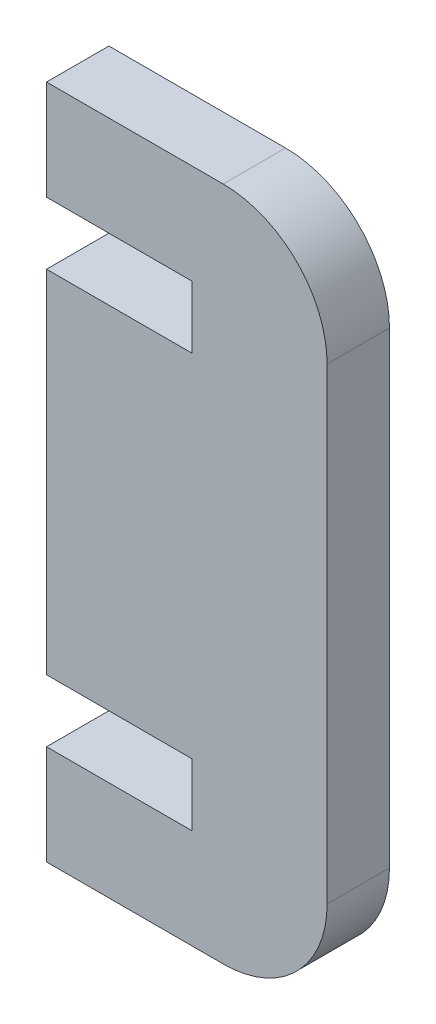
ISO-10303-21;
HEADER;
FILE_DESCRIPTION(('STEP AP214'),'2;1');
FILE_NAME('part.step','',(''),(''),'','','');
FILE_SCHEMA(('AUTOMOTIVE_DESIGN { 1 0 10303 214 1 1 1 1 }'));
ENDSEC;
DATA;
#1=APPLICATION_CONTEXT('core data for automotive mechanical design processes');
#2=APPLICATION_PROTOCOL_DEFINITION('international standard','automotive_design',2000,#1);
#3=PRODUCT_CONTEXT('',#1,'mechanical');
#4=PRODUCT('Part','Part','',(#3));
#5=PRODUCT_RELATED_PRODUCT_CATEGORY('part','',(#4));
#6=PRODUCT_DEFINITION_FORMATION('','',#4);
#7=PRODUCT_DEFINITION_CONTEXT('part definition',#1,'design');
#8=PRODUCT_DEFINITION('design','',#6,#7);
#9=PRODUCT_DEFINITION_SHAPE('','',#8);
#10=(LENGTH_UNIT() NAMED_UNIT(*) SI_UNIT(.MILLI.,.METRE.));
#11=(NAMED_UNIT(*) PLANE_ANGLE_UNIT() SI_UNIT($,.RADIAN.));
#12=(NAMED_UNIT(*) SI_UNIT($,.STERADIAN.) SOLID_ANGLE_UNIT());
#13=UNCERTAINTY_MEASURE_WITH_UNIT(LENGTH_MEASURE(1.E-05),#10,'distance_accuracy_value','');
#14=(GEOMETRIC_REPRESENTATION_CONTEXT(3) GLOBAL_UNCERTAINTY_ASSIGNED_CONTEXT((#13)) GLOBAL_UNIT_ASSIGNED_CONTEXT((#10,
#11,#12)) REPRESENTATION_CONTEXT('',''));
#15=CARTESIAN_POINT('',(0.,0.,0.));
#16=DIRECTION('',(0.,0.,1.));
#17=DIRECTION('',(1.,0.,0.));
#18=AXIS2_PLACEMENT_3D('',#15,#16,#17);
#19=CARTESIAN_POINT('',(-6.75,16.25,3.));
#20=DIRECTION('',(1.,0.,0.));
#21=DIRECTION('',(0.,0.,-1.));
#22=AXIS2_PLACEMENT_3D('',#19,#20,#21);
#23=PLANE('',#22);
#24=DIRECTION('',(0.,-1.,0.));
#25=VECTOR('',#24,1.);
#26=CARTESIAN_POINT('',(-6.75,16.25,0.));
#27=LINE('',#26,#25);
#28=CARTESIAN_POINT('',(-6.75,16.25,0.));
#29=VERTEX_POINT('',#28);
#30=CARTESIAN_POINT('',(-6.75,11.45,0.));
#31=VERTEX_POINT('',#30);
#32=EDGE_CURVE('E169',#29,#31,#27,.T.);
#33=ORIENTED_EDGE('',*,*,#32,.T.);
#34=DIRECTION('',(0.,0.,-1.));
#35=VECTOR('',#34,1.);
#36=CARTESIAN_POINT('',(-6.75,11.45,3.));
#37=LINE('',#36,#35);
#38=CARTESIAN_POINT('',(-6.75,11.45,3.));
#39=VERTEX_POINT('',#38);
#40=EDGE_CURVE('E11',#39,#31,#37,.T.);
#41=ORIENTED_EDGE('',*,*,#40,.F.);
#42=DIRECTION('',(0.,-1.,0.));
#43=VECTOR('',#42,1.);
#44=CARTESIAN_POINT('',(-6.75,16.25,3.));
#45=LINE('',#44,#43);
#46=CARTESIAN_POINT('',(-6.75,16.25,3.));
#47=VERTEX_POINT('',#46);
#48=EDGE_CURVE('E195',#47,#39,#45,.T.);
#49=ORIENTED_EDGE('',*,*,#48,.F.);
#50=DIRECTION('',(0.,0.,-1.));
#51=VECTOR('',#50,1.);
#52=CARTESIAN_POINT('',(-6.75,16.25,3.));
#53=LINE('',#52,#51);
#54=EDGE_CURVE('E165',#47,#29,#53,.T.);
#55=ORIENTED_EDGE('',*,*,#54,.T.);
#56=EDGE_LOOP('',(#33,#41,#49,#55));
#57=FACE_BOUND('',#56,.T.);
#58=ADVANCED_FACE('F37',(#57),#23,.F.);
#59=CARTESIAN_POINT('',(-6.75,11.45,3.));
#60=DIRECTION('',(0.,1.,0.));
#61=DIRECTION('',(0.,0.,1.));
#62=AXIS2_PLACEMENT_3D('',#59,#60,#61);
#63=PLANE('',#62);
#64=DIRECTION('',(1.,0.,0.));
#65=VECTOR('',#64,1.);
#66=CARTESIAN_POINT('',(-6.75,11.45,0.));
#67=LINE('',#66,#65);
#68=CARTESIAN_POINT('',(0.249999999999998,11.45,0.));
#69=VERTEX_POINT('',#68);
#70=EDGE_CURVE('E172',#31,#69,#67,.T.);
#71=ORIENTED_EDGE('',*,*,#70,.T.);
#72=DIRECTION('',(0.,0.,-1.));
#73=VECTOR('',#72,1.);
#74=CARTESIAN_POINT('',(0.249999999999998,11.45,3.));
#75=LINE('',#74,#73);
#76=CARTESIAN_POINT('',(0.249999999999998,11.45,3.));
#77=VERTEX_POINT('',#76);
#78=EDGE_CURVE('E45',#77,#69,#75,.T.);
#79=ORIENTED_EDGE('',*,*,#78,.F.);
#80=DIRECTION('',(1.,0.,0.));
#81=VECTOR('',#80,1.);
#82=CARTESIAN_POINT('',(-6.75,11.45,3.));
#83=LINE('',#82,#81);
#84=EDGE_CURVE('E114',#39,#77,#83,.T.);
#85=ORIENTED_EDGE('',*,*,#84,.F.);
#86=ORIENTED_EDGE('',*,*,#40,.T.);
#87=EDGE_LOOP('',(#71,#79,#85,#86));
#88=FACE_BOUND('',#87,.T.);
#89=ADVANCED_FACE('F283',(#88),#63,.F.);
#90=CARTESIAN_POINT('',(0.249999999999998,11.45,3.));
#91=DIRECTION('',(1.,0.,0.));
#92=DIRECTION('',(0.,1.,0.));
#93=AXIS2_PLACEMENT_3D('',#90,#91,#92);
#94=PLANE('',#93);
#95=DIRECTION('',(0.,-1.,0.));
#96=VECTOR('',#95,1.);
#97=CARTESIAN_POINT('',(0.249999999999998,11.45,0.));
#98=LINE('',#97,#96);
#99=CARTESIAN_POINT('',(0.249999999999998,8.45,0.));
#100=VERTEX_POINT('',#99);
#101=EDGE_CURVE('E174',#69,#100,#98,.T.);
#102=ORIENTED_EDGE('',*,*,#101,.T.);
#103=DIRECTION('',(0.,0.,-1.));
#104=VECTOR('',#103,1.);
#105=CARTESIAN_POINT('',(0.249999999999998,8.45,3.));
#106=LINE('',#105,#104);
#107=CARTESIAN_POINT('',(0.249999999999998,8.45,3.));
#108=VERTEX_POINT('',#107);
#109=EDGE_CURVE('E220',#108,#100,#106,.T.);
#110=ORIENTED_EDGE('',*,*,#109,.F.);
#111=DIRECTION('',(0.,-1.,0.));
#112=VECTOR('',#111,1.);
#113=CARTESIAN_POINT('',(0.249999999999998,11.45,3.));
#114=LINE('',#113,#112);
#115=EDGE_CURVE('E228',#77,#108,#114,.T.);
#116=ORIENTED_EDGE('',*,*,#115,.F.);
#117=ORIENTED_EDGE('',*,*,#78,.T.);
#118=EDGE_LOOP('',(#102,#110,#116,#117));
#119=FACE_BOUND('',#118,.T.);
#120=ADVANCED_FACE('F226',(#119),#94,.F.);
#121=CARTESIAN_POINT('',(-6.75,8.45,3.));
#122=DIRECTION('',(0.,-1.,0.));
#123=DIRECTION('',(0.,0.,-1.));
#124=AXIS2_PLACEMENT_3D('',#121,#122,#123);
#125=PLANE('',#124);
#126=DIRECTION('',(-1.,0.,0.));
#127=VECTOR('',#126,1.);
#128=CARTESIAN_POINT('',(-6.75,8.45,0.));
#129=LINE('',#128,#127);
#130=CARTESIAN_POINT('',(-6.75,8.45,0.));
#131=VERTEX_POINT('',#130);
#132=EDGE_CURVE('E176',#100,#131,#129,.T.);
#133=ORIENTED_EDGE('',*,*,#132,.T.);
#134=DIRECTION('',(0.,0.,-1.));
#135=VECTOR('',#134,1.);
#136=CARTESIAN_POINT('',(-6.75,8.45,3.));
#137=LINE('',#136,#135);
#138=CARTESIAN_POINT('',(-6.75,8.45,3.));
#139=VERTEX_POINT('',#138);
#140=EDGE_CURVE('E217',#139,#131,#137,.T.);
#141=ORIENTED_EDGE('',*,*,#140,.F.);
#142=DIRECTION('',(-1.,0.,0.));
#143=VECTOR('',#142,1.);
#144=CARTESIAN_POINT('',(-6.75,8.45,3.));
#145=LINE('',#144,#143);
#146=EDGE_CURVE('E246',#108,#139,#145,.T.);
#147=ORIENTED_EDGE('',*,*,#146,.F.);
#148=ORIENTED_EDGE('',*,*,#109,.T.);
#149=EDGE_LOOP('',(#133,#141,#147,#148));
#150=FACE_BOUND('',#149,.T.);
#151=ADVANCED_FACE('F237',(#150),#125,.F.);
#152=CARTESIAN_POINT('',(-6.75,8.45,3.));
#153=DIRECTION('',(1.,0.,0.));
#154=DIRECTION('',(0.,1.,0.));
#155=AXIS2_PLACEMENT_3D('',#152,#153,#154);
#156=PLANE('',#155);
#157=DIRECTION('',(0.,-1.,0.));
#158=VECTOR('',#157,1.);
#159=CARTESIAN_POINT('',(-6.75,8.45,0.));
#160=LINE('',#159,#158);
#161=CARTESIAN_POINT('',(-6.75,-8.45,0.));
#162=VERTEX_POINT('',#161);
#163=EDGE_CURVE('E178',#131,#162,#160,.T.);
#164=ORIENTED_EDGE('',*,*,#163,.T.);
#165=DIRECTION('',(0.,0.,-1.));
#166=VECTOR('',#165,1.);
#167=CARTESIAN_POINT('',(-6.75,-8.45,3.));
#168=LINE('',#167,#166);
#169=CARTESIAN_POINT('',(-6.75,-8.45,3.));
#170=VERTEX_POINT('',#169);
#171=EDGE_CURVE('E214',#170,#162,#168,.T.);
#172=ORIENTED_EDGE('',*,*,#171,.F.);
#173=DIRECTION('',(0.,-1.,0.));
#174=VECTOR('',#173,1.);
#175=CARTESIAN_POINT('',(-6.75,8.45,3.));
#176=LINE('',#175,#174);
#177=EDGE_CURVE('E243',#139,#170,#176,.T.);
#178=ORIENTED_EDGE('',*,*,#177,.F.);
#179=ORIENTED_EDGE('',*,*,#140,.T.);
#180=EDGE_LOOP('',(#164,#172,#178,#179));
#181=FACE_BOUND('',#180,.T.);
#182=ADVANCED_FACE('F241',(#181),#156,.F.);
#183=CARTESIAN_POINT('',(-6.75,-8.45,3.));
#184=DIRECTION('',(0.,1.,0.));
#185=DIRECTION('',(-1.,0.,0.));
#186=AXIS2_PLACEMENT_3D('',#183,#184,#185);
#187=PLANE('',#186);
#188=DIRECTION('',(1.,0.,0.));
#189=VECTOR('',#188,1.);
#190=CARTESIAN_POINT('',(-6.75,-8.45,0.));
#191=LINE('',#190,#189);
#192=CARTESIAN_POINT('',(0.250000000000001,-8.45000000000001,0.));
#193=VERTEX_POINT('',#192);
#194=EDGE_CURVE('E180',#162,#193,#191,.T.);
#195=ORIENTED_EDGE('',*,*,#194,.T.);
#196=DIRECTION('',(0.,0.,-1.));
#197=VECTOR('',#196,1.);
#198=CARTESIAN_POINT('',(0.250000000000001,-8.45000000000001,3.));
#199=LINE('',#198,#197);
#200=CARTESIAN_POINT('',(0.250000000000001,-8.45000000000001,3.));
#201=VERTEX_POINT('',#200);
#202=EDGE_CURVE('E211',#201,#193,#199,.T.);
#203=ORIENTED_EDGE('',*,*,#202,.F.);
#204=DIRECTION('',(1.,0.,0.));
#205=VECTOR('',#204,1.);
#206=CARTESIAN_POINT('',(-6.75,-8.45,3.));
#207=LINE('',#206,#205);
#208=EDGE_CURVE('E245',#170,#201,#207,.T.);
#209=ORIENTED_EDGE('',*,*,#208,.F.);
#210=ORIENTED_EDGE('',*,*,#171,.T.);
#211=EDGE_LOOP('',(#195,#203,#209,#210));
#212=FACE_BOUND('',#211,.T.);
#213=ADVANCED_FACE('F296',(#212),#187,.F.);
#214=CARTESIAN_POINT('',(0.250000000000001,-8.45000000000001,3.));
#215=DIRECTION('',(1.,0.,0.));
#216=DIRECTION('',(0.,1.,0.));
#217=AXIS2_PLACEMENT_3D('',#214,#215,#216);
#218=PLANE('',#217);
#219=DIRECTION('',(0.,-1.,0.));
#220=VECTOR('',#219,1.);
#221=CARTESIAN_POINT('',(0.250000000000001,-8.45000000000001,0.));
#222=LINE('',#221,#220);
#223=CARTESIAN_POINT('',(0.250000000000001,-11.45,0.));
#224=VERTEX_POINT('',#223);
#225=EDGE_CURVE('E182',#193,#224,#222,.T.);
#226=ORIENTED_EDGE('',*,*,#225,.T.);
#227=DIRECTION('',(0.,0.,-1.));
#228=VECTOR('',#227,1.);
#229=CARTESIAN_POINT('',(0.250000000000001,-11.45,3.));
#230=LINE('',#229,#228);
#231=CARTESIAN_POINT('',(0.250000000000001,-11.45,3.));
#232=VERTEX_POINT('',#231);
#233=EDGE_CURVE('E208',#232,#224,#230,.T.);
#234=ORIENTED_EDGE('',*,*,#233,.F.);
#235=DIRECTION('',(0.,-1.,0.));
#236=VECTOR('',#235,1.);
#237=CARTESIAN_POINT('',(0.250000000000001,-8.45000000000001,3.));
#238=LINE('',#237,#236);
#239=EDGE_CURVE('E248',#201,#232,#238,.T.);
#240=ORIENTED_EDGE('',*,*,#239,.F.);
#241=ORIENTED_EDGE('',*,*,#202,.T.);
#242=EDGE_LOOP('',(#226,#234,#240,#241));
#243=FACE_BOUND('',#242,.T.);
#244=ADVANCED_FACE('F299',(#243),#218,.F.);
#245=CARTESIAN_POINT('',(-6.75,-11.45,3.));
#246=DIRECTION('',(0.,-1.,0.));
#247=DIRECTION('',(0.,0.,-1.));
#248=AXIS2_PLACEMENT_3D('',#245,#246,#247);
#249=PLANE('',#248);
#250=DIRECTION('',(-1.,0.,0.));
#251=VECTOR('',#250,1.);
#252=CARTESIAN_POINT('',(-6.75,-11.45,0.));
#253=LINE('',#252,#251);
#254=CARTESIAN_POINT('',(-6.75,-11.45,0.));
#255=VERTEX_POINT('',#254);
#256=EDGE_CURVE('E184',#224,#255,#253,.T.);
#257=ORIENTED_EDGE('',*,*,#256,.T.);
#258=DIRECTION('',(0.,0.,-1.));
#259=VECTOR('',#258,1.);
#260=CARTESIAN_POINT('',(-6.75,-11.45,3.));
#261=LINE('',#260,#259);
#262=CARTESIAN_POINT('',(-6.75,-11.45,3.));
#263=VERTEX_POINT('',#262);
#264=EDGE_CURVE('E205',#263,#255,#261,.T.);
#265=ORIENTED_EDGE('',*,*,#264,.F.);
#266=DIRECTION('',(-1.,0.,0.));
#267=VECTOR('',#266,1.);
#268=CARTESIAN_POINT('',(-6.75,-11.45,3.));
#269=LINE('',#268,#267);
#270=EDGE_CURVE('E254',#232,#263,#269,.T.);
#271=ORIENTED_EDGE('',*,*,#270,.F.);
#272=ORIENTED_EDGE('',*,*,#233,.T.);
#273=EDGE_LOOP('',(#257,#265,#271,#272));
#274=FACE_BOUND('',#273,.T.);
#275=ADVANCED_FACE('F303',(#274),#249,.F.);
#276=CARTESIAN_POINT('',(-6.75,-11.45,3.));
#277=DIRECTION('',(1.,0.,0.));
#278=DIRECTION('',(0.,1.,0.));
#279=AXIS2_PLACEMENT_3D('',#276,#277,#278);
#280=PLANE('',#279);
#281=DIRECTION('',(0.,-1.,0.));
#282=VECTOR('',#281,1.);
#283=CARTESIAN_POINT('',(-6.75,-11.45,0.));
#284=LINE('',#283,#282);
#285=CARTESIAN_POINT('',(-6.75,-16.25,0.));
#286=VERTEX_POINT('',#285);
#287=EDGE_CURVE('E186',#255,#286,#284,.T.);
#288=ORIENTED_EDGE('',*,*,#287,.T.);
#289=DIRECTION('',(0.,0.,-1.));
#290=VECTOR('',#289,1.);
#291=CARTESIAN_POINT('',(-6.75,-16.25,3.));
#292=LINE('',#291,#290);
#293=CARTESIAN_POINT('',(-6.75,-16.25,3.));
#294=VERTEX_POINT('',#293);
#295=EDGE_CURVE('E202',#294,#286,#292,.T.);
#296=ORIENTED_EDGE('',*,*,#295,.F.);
#297=DIRECTION('',(0.,-1.,0.));
#298=VECTOR('',#297,1.);
#299=CARTESIAN_POINT('',(-6.75,-11.45,3.));
#300=LINE('',#299,#298);
#301=EDGE_CURVE('E256',#263,#294,#300,.T.);
#302=ORIENTED_EDGE('',*,*,#301,.F.);
#303=ORIENTED_EDGE('',*,*,#264,.T.);
#304=EDGE_LOOP('',(#288,#296,#302,#303));
#305=FACE_BOUND('',#304,.T.);
#306=ADVANCED_FACE('F307',(#305),#280,.F.);
#307=CARTESIAN_POINT('',(-6.75,-16.25,3.));
#308=DIRECTION('',(0.,1.,0.));
#309=DIRECTION('',(-1.,0.,0.));
#310=AXIS2_PLACEMENT_3D('',#307,#308,#309);
#311=PLANE('',#310);
#312=DIRECTION('',(1.,0.,0.));
#313=VECTOR('',#312,1.);
#314=CARTESIAN_POINT('',(-6.75,-16.25,0.));
#315=LINE('',#314,#313);
#316=CARTESIAN_POINT('',(1.75,-16.25,0.));
#317=VERTEX_POINT('',#316);
#318=EDGE_CURVE('E188',#286,#317,#315,.T.);
#319=ORIENTED_EDGE('',*,*,#318,.T.);
#320=DIRECTION('',(0.,0.,-1.));
#321=VECTOR('',#320,1.);
#322=CARTESIAN_POINT('',(1.75,-16.25,3.));
#323=LINE('',#322,#321);
#324=CARTESIAN_POINT('',(1.75,-16.25,3.));
#325=VERTEX_POINT('',#324);
#326=EDGE_CURVE('E199',#325,#317,#323,.T.);
#327=ORIENTED_EDGE('',*,*,#326,.F.);
#328=DIRECTION('',(1.,0.,0.));
#329=VECTOR('',#328,1.);
#330=CARTESIAN_POINT('',(-6.75,-16.25,3.));
#331=LINE('',#330,#329);
#332=EDGE_CURVE('E258',#294,#325,#331,.T.);
#333=ORIENTED_EDGE('',*,*,#332,.F.);
#334=ORIENTED_EDGE('',*,*,#295,.T.);
#335=EDGE_LOOP('',(#319,#327,#333,#334));
#336=FACE_BOUND('',#335,.T.);
#337=ADVANCED_FACE('F264',(#336),#311,.F.);
#338=CARTESIAN_POINT('',(1.75,-11.25,3.));
#339=DIRECTION('',(0.,0.,-1.));
#340=DIRECTION('',(-1.,0.,0.));
#341=AXIS2_PLACEMENT_3D('',#338,#339,#340);
#342=CYLINDRICAL_SURFACE('',#341,5.);
#343=CARTESIAN_POINT('',(1.75,-11.25,0.));
#344=DIRECTION('',(0.,0.,1.));
#345=DIRECTION('',(-1.,0.,0.));
#346=AXIS2_PLACEMENT_3D('',#343,#344,#345);
#347=CIRCLE('',#346,5.);
#348=CARTESIAN_POINT('',(6.75,-11.25,0.));
#349=VERTEX_POINT('',#348);
#350=EDGE_CURVE('E190',#317,#349,#347,.T.);
#351=ORIENTED_EDGE('',*,*,#350,.T.);
#352=DIRECTION('',(0.,0.,-1.));
#353=VECTOR('',#352,1.);
#354=CARTESIAN_POINT('',(6.75,-11.25,3.));
#355=LINE('',#354,#353);
#356=CARTESIAN_POINT('',(6.75,-11.25,3.));
#357=VERTEX_POINT('',#356);
#358=EDGE_CURVE('E160',#357,#349,#355,.T.);
#359=ORIENTED_EDGE('',*,*,#358,.F.);
#360=CARTESIAN_POINT('',(1.75,-11.25,3.));
#361=DIRECTION('',(0.,0.,1.));
#362=DIRECTION('',(-1.,0.,0.));
#363=AXIS2_PLACEMENT_3D('',#360,#361,#362);
#364=CIRCLE('',#363,5.);
#365=EDGE_CURVE('E151',#325,#357,#364,.T.);
#366=ORIENTED_EDGE('',*,*,#365,.F.);
#367=ORIENTED_EDGE('',*,*,#326,.T.);
#368=EDGE_LOOP('',(#351,#359,#366,#367));
#369=FACE_BOUND('',#368,.T.);
#370=ADVANCED_FACE('F268',(#369),#342,.T.);
#371=CARTESIAN_POINT('',(6.75,11.25,3.));
#372=DIRECTION('',(-1.,0.,0.));
#373=DIRECTION('',(0.,-1.,0.));
#374=AXIS2_PLACEMENT_3D('',#371,#372,#373);
#375=PLANE('',#374);
#376=DIRECTION('',(0.,1.,0.));
#377=VECTOR('',#376,1.);
#378=CARTESIAN_POINT('',(6.75,11.25,0.));
#379=LINE('',#378,#377);
#380=CARTESIAN_POINT('',(6.75,11.25,0.));
#381=VERTEX_POINT('',#380);
#382=EDGE_CURVE('E159',#349,#381,#379,.T.);
#383=ORIENTED_EDGE('',*,*,#382,.T.);
#384=DIRECTION('',(0.,0.,-1.));
#385=VECTOR('',#384,1.);
#386=CARTESIAN_POINT('',(6.75,11.25,3.));
#387=LINE('',#386,#385);
#388=CARTESIAN_POINT('',(6.75,11.25,3.));
#389=VERTEX_POINT('',#388);
#390=EDGE_CURVE('E156',#389,#381,#387,.T.);
#391=ORIENTED_EDGE('',*,*,#390,.F.);
#392=DIRECTION('',(0.,1.,0.));
#393=VECTOR('',#392,1.);
#394=CARTESIAN_POINT('',(6.75,11.25,3.));
#395=LINE('',#394,#393);
#396=EDGE_CURVE('E145',#357,#389,#395,.T.);
#397=ORIENTED_EDGE('',*,*,#396,.F.);
#398=ORIENTED_EDGE('',*,*,#358,.T.);
#399=EDGE_LOOP('',(#383,#391,#397,#398));
#400=FACE_BOUND('',#399,.T.);
#401=ADVANCED_FACE('F157',(#400),#375,.F.);
#402=CARTESIAN_POINT('',(1.75,11.25,3.));
#403=DIRECTION('',(0.,0.,-1.));
#404=DIRECTION('',(-1.,0.,0.));
#405=AXIS2_PLACEMENT_3D('',#402,#403,#404);
#406=CYLINDRICAL_SURFACE('',#405,5.);
#407=CARTESIAN_POINT('',(1.75,11.25,0.));
#408=DIRECTION('',(0.,0.,1.));
#409=DIRECTION('',(1.,0.,0.));
#410=AXIS2_PLACEMENT_3D('',#407,#408,#409);
#411=CIRCLE('',#410,5.);
#412=CARTESIAN_POINT('',(1.75,16.25,0.));
#413=VERTEX_POINT('',#412);
#414=EDGE_CURVE('E100',#381,#413,#411,.T.);
#415=ORIENTED_EDGE('',*,*,#414,.T.);
#416=DIRECTION('',(0.,0.,-1.));
#417=VECTOR('',#416,1.);
#418=CARTESIAN_POINT('',(1.75,16.25,3.));
#419=LINE('',#418,#417);
#420=CARTESIAN_POINT('',(1.75,16.25,3.));
#421=VERTEX_POINT('',#420);
#422=EDGE_CURVE('E161',#421,#413,#419,.T.);
#423=ORIENTED_EDGE('',*,*,#422,.F.);
#424=CARTESIAN_POINT('',(1.75,11.25,3.));
#425=DIRECTION('',(0.,0.,1.));
#426=DIRECTION('',(1.,0.,0.));
#427=AXIS2_PLACEMENT_3D('',#424,#425,#426);
#428=CIRCLE('',#427,5.);
#429=EDGE_CURVE('E149',#389,#421,#428,.T.);
#430=ORIENTED_EDGE('',*,*,#429,.F.);
#431=ORIENTED_EDGE('',*,*,#390,.T.);
#432=EDGE_LOOP('',(#415,#423,#430,#431));
#433=FACE_BOUND('',#432,.T.);
#434=ADVANCED_FACE('F163',(#433),#406,.T.);
#435=CARTESIAN_POINT('',(-6.75,16.25,3.));
#436=DIRECTION('',(0.,-1.,0.));
#437=DIRECTION('',(1.,0.,0.));
#438=AXIS2_PLACEMENT_3D('',#435,#436,#437);
#439=PLANE('',#438);
#440=DIRECTION('',(-1.,0.,0.));
#441=VECTOR('',#440,1.);
#442=CARTESIAN_POINT('',(-6.75,16.25,0.));
#443=LINE('',#442,#441);
#444=EDGE_CURVE('E106',#413,#29,#443,.T.);
#445=ORIENTED_EDGE('',*,*,#444,.T.);
#446=ORIENTED_EDGE('',*,*,#54,.F.);
#447=DIRECTION('',(-1.,0.,0.));
#448=VECTOR('',#447,1.);
#449=CARTESIAN_POINT('',(-6.75,16.25,3.));
#450=LINE('',#449,#448);
#451=EDGE_CURVE('E53',#421,#47,#450,.T.);
#452=ORIENTED_EDGE('',*,*,#451,.F.);
#453=ORIENTED_EDGE('',*,*,#422,.T.);
#454=EDGE_LOOP('',(#445,#446,#452,#453));
#455=FACE_BOUND('',#454,.T.);
#456=ADVANCED_FACE('F272',(#455),#439,.F.);
#457=CARTESIAN_POINT('',(1.75,-11.25,3.));
#458=DIRECTION('',(0.,0.,-1.));
#459=DIRECTION('',(-1.,0.,0.));
#460=AXIS2_PLACEMENT_3D('',#457,#458,#459);
#461=PLANE('',#460);
#462=ORIENTED_EDGE('',*,*,#48,.T.);
#463=ORIENTED_EDGE('',*,*,#84,.T.);
#464=ORIENTED_EDGE('',*,*,#115,.T.);
#465=ORIENTED_EDGE('',*,*,#146,.T.);
#466=ORIENTED_EDGE('',*,*,#177,.T.);
#467=ORIENTED_EDGE('',*,*,#208,.T.);
#468=ORIENTED_EDGE('',*,*,#239,.T.);
#469=ORIENTED_EDGE('',*,*,#270,.T.);
#470=ORIENTED_EDGE('',*,*,#301,.T.);
#471=ORIENTED_EDGE('',*,*,#332,.T.);
#472=ORIENTED_EDGE('',*,*,#365,.T.);
#473=ORIENTED_EDGE('',*,*,#396,.T.);
#474=ORIENTED_EDGE('',*,*,#429,.T.);
#475=ORIENTED_EDGE('',*,*,#451,.T.);
#476=EDGE_LOOP('',(#462,#463,#464,#465,#466,#467,#468,#469,#470,#471,#472,#473,#474,#475));
#477=FACE_BOUND('',#476,.T.);
#478=ADVANCED_FACE('F147',(#477),#461,.F.);
#479=CARTESIAN_POINT('',(1.75,-11.25,0.));
#480=DIRECTION('',(0.,0.,-1.));
#481=DIRECTION('',(-1.,0.,0.));
#482=AXIS2_PLACEMENT_3D('',#479,#480,#481);
#483=PLANE('',#482);
#484=ORIENTED_EDGE('',*,*,#32,.F.);
#485=ORIENTED_EDGE('',*,*,#444,.F.);
#486=ORIENTED_EDGE('',*,*,#414,.F.);
#487=ORIENTED_EDGE('',*,*,#382,.F.);
#488=ORIENTED_EDGE('',*,*,#350,.F.);
#489=ORIENTED_EDGE('',*,*,#318,.F.);
#490=ORIENTED_EDGE('',*,*,#287,.F.);
#491=ORIENTED_EDGE('',*,*,#256,.F.);
#492=ORIENTED_EDGE('',*,*,#225,.F.);
#493=ORIENTED_EDGE('',*,*,#194,.F.);
#494=ORIENTED_EDGE('',*,*,#163,.F.);
#495=ORIENTED_EDGE('',*,*,#132,.F.);
#496=ORIENTED_EDGE('',*,*,#101,.F.);
#497=ORIENTED_EDGE('',*,*,#70,.F.);
#498=EDGE_LOOP('',(#484,#485,#486,#487,#488,#489,#490,#491,#492,#493,#494,#495,#496,#497));
#499=FACE_BOUND('',#498,.T.);
#500=ADVANCED_FACE('F232',(#499),#483,.T.);
#501=CLOSED_SHELL('',(#58,#89,#120,#151,#182,#213,#244,#275,#306,#337,#370,#401,#434,#456,#478,#500));
#502=MANIFOLD_SOLID_BREP('B2',#501);
#503=ADVANCED_BREP_SHAPE_REPRESENTATION('',(#18,#502),#14);
#504=SHAPE_DEFINITION_REPRESENTATION(#9,#503);
ENDSEC;
END-ISO-10303-21;
